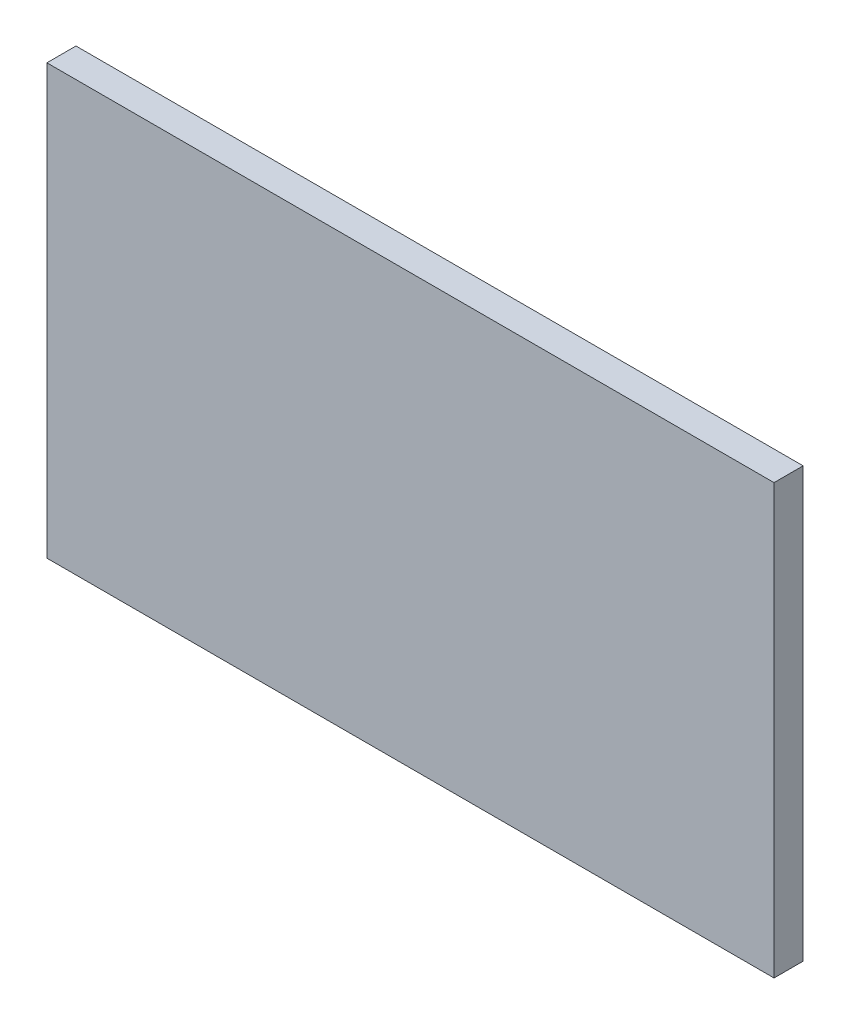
from build123d import *

# Parameters (mm, degrees)
SKETCH1_W           = 25.4
SKETCH1_H           = 14.986
BOSS_EXTRUDE1_DEPTH = 1.016


with BuildPart() as part:
    # Sketch1 → Boss-Extrude1 (new body)
    with BuildSketch(Plane.XY):
        with Locations((-12.7, -7.493)):
            Rectangle(SKETCH1_W, SKETCH1_H)
    extrude(amount=BOSS_EXTRUDE1_DEPTH)


solid = part.part
